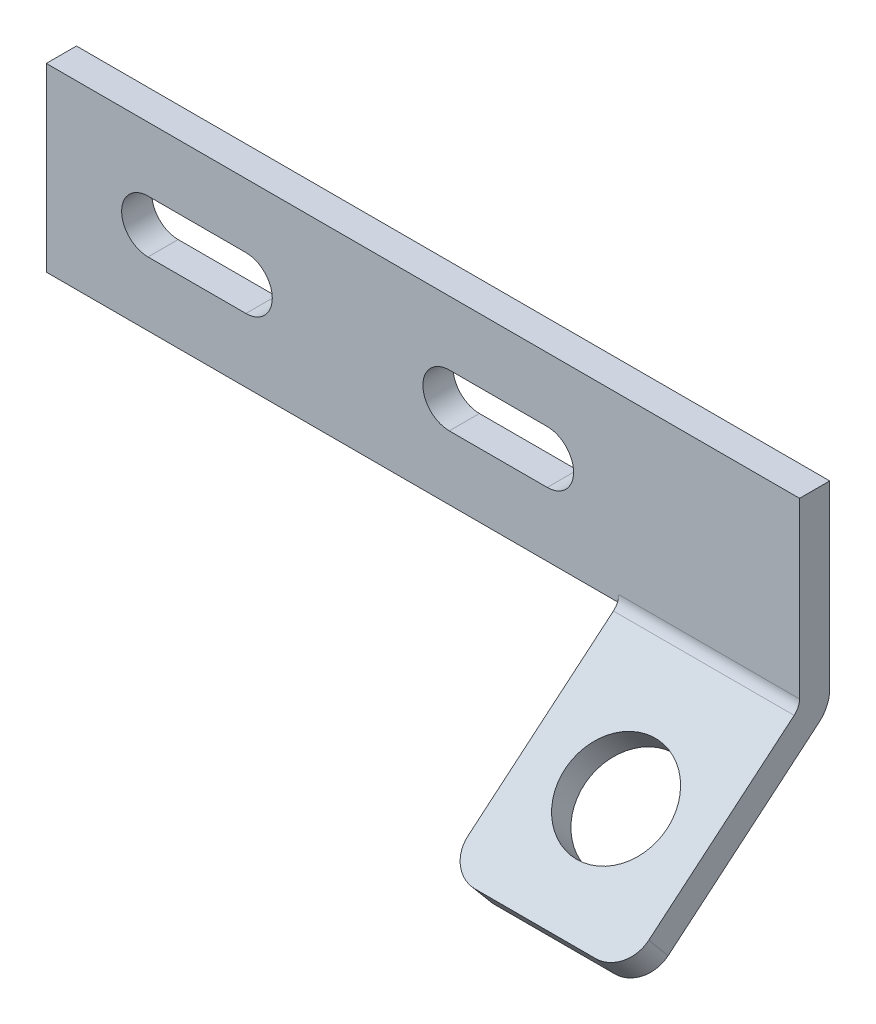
ISO-10303-21;
HEADER;
FILE_DESCRIPTION(('STEP AP214'),'2;1');
FILE_NAME('part.step','',(''),(''),'','','');
FILE_SCHEMA(('AUTOMOTIVE_DESIGN { 1 0 10303 214 1 1 1 1 }'));
ENDSEC;
DATA;
#1=APPLICATION_CONTEXT('core data for automotive mechanical design processes');
#2=APPLICATION_PROTOCOL_DEFINITION('international standard','automotive_design',2000,#1);
#3=PRODUCT_CONTEXT('',#1,'mechanical');
#4=PRODUCT('Part','Part','',(#3));
#5=PRODUCT_RELATED_PRODUCT_CATEGORY('part','',(#4));
#6=PRODUCT_DEFINITION_FORMATION('','',#4);
#7=PRODUCT_DEFINITION_CONTEXT('part definition',#1,'design');
#8=PRODUCT_DEFINITION('design','',#6,#7);
#9=PRODUCT_DEFINITION_SHAPE('','',#8);
#10=(LENGTH_UNIT() NAMED_UNIT(*) SI_UNIT(.MILLI.,.METRE.));
#11=(NAMED_UNIT(*) PLANE_ANGLE_UNIT() SI_UNIT($,.RADIAN.));
#12=(NAMED_UNIT(*) SI_UNIT($,.STERADIAN.) SOLID_ANGLE_UNIT());
#13=UNCERTAINTY_MEASURE_WITH_UNIT(LENGTH_MEASURE(1.E-05),#10,'distance_accuracy_value','');
#14=(GEOMETRIC_REPRESENTATION_CONTEXT(3) GLOBAL_UNCERTAINTY_ASSIGNED_CONTEXT((#13)) GLOBAL_UNIT_ASSIGNED_CONTEXT((#10,
#11,#12)) REPRESENTATION_CONTEXT('',''));
#15=CARTESIAN_POINT('',(0.,0.,0.));
#16=DIRECTION('',(0.,0.,1.));
#17=DIRECTION('',(1.,0.,0.));
#18=AXIS2_PLACEMENT_3D('',#15,#16,#17);
#19=CARTESIAN_POINT('',(-3.63955992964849,-10.6,-2.));
#20=DIRECTION('',(-1.,0.,0.));
#21=DIRECTION('',(0.,0.,1.));
#22=AXIS2_PLACEMENT_3D('',#19,#20,#21);
#23=PLANE('',#22);
#24=DIRECTION('',(0.,-1.,0.));
#25=VECTOR('',#24,1.);
#26=CARTESIAN_POINT('',(-3.63955992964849,-10.6,0.));
#27=LINE('',#26,#25);
#28=CARTESIAN_POINT('',(-3.63955992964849,1.4,0.));
#29=VERTEX_POINT('',#28);
#30=CARTESIAN_POINT('',(-3.63955992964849,-10.6,0.));
#31=VERTEX_POINT('',#30);
#32=EDGE_CURVE('E236',#29,#31,#27,.T.);
#33=ORIENTED_EDGE('',*,*,#32,.F.);
#34=DIRECTION('',(0.,0.,1.));
#35=VECTOR('',#34,1.);
#36=CARTESIAN_POINT('',(-3.63955992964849,1.4,-2.));
#37=LINE('',#36,#35);
#38=CARTESIAN_POINT('',(-3.63955992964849,1.4,-2.));
#39=VERTEX_POINT('',#38);
#40=EDGE_CURVE('E259',#39,#29,#37,.T.);
#41=ORIENTED_EDGE('',*,*,#40,.F.);
#42=DIRECTION('',(0.,-1.,0.));
#43=VECTOR('',#42,1.);
#44=CARTESIAN_POINT('',(-3.63955992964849,-10.6,-2.));
#45=LINE('',#44,#43);
#46=CARTESIAN_POINT('',(-3.63955992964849,-10.6,-2.));
#47=VERTEX_POINT('',#46);
#48=EDGE_CURVE('E237',#39,#47,#45,.T.);
#49=ORIENTED_EDGE('',*,*,#48,.T.);
#50=DIRECTION('',(0.,0.,1.));
#51=VECTOR('',#50,1.);
#52=CARTESIAN_POINT('',(-3.63955992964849,-10.6,-2.));
#53=LINE('',#52,#51);
#54=EDGE_CURVE('E249',#47,#31,#53,.T.);
#55=ORIENTED_EDGE('',*,*,#54,.T.);
#56=EDGE_LOOP('',(#33,#41,#49,#55));
#57=FACE_BOUND('',#56,.T.);
#58=ADVANCED_FACE('F16',(#57),#23,.T.);
#59=CARTESIAN_POINT('',(-3.63955992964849,1.4,-2.));
#60=DIRECTION('',(0.,1.,0.));
#61=DIRECTION('',(-1.,0.,0.));
#62=AXIS2_PLACEMENT_3D('',#59,#60,#61);
#63=PLANE('',#62);
#64=DIRECTION('',(-1.,0.,0.));
#65=VECTOR('',#64,1.);
#66=CARTESIAN_POINT('',(-3.63955992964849,1.4,0.));
#67=LINE('',#66,#65);
#68=CARTESIAN_POINT('',(46.3604400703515,1.4,0.));
#69=VERTEX_POINT('',#68);
#70=EDGE_CURVE('E241',#69,#29,#67,.T.);
#71=ORIENTED_EDGE('',*,*,#70,.F.);
#72=DIRECTION('',(0.,0.,1.));
#73=VECTOR('',#72,1.);
#74=CARTESIAN_POINT('',(46.3604400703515,1.4,-2.));
#75=LINE('',#74,#73);
#76=CARTESIAN_POINT('',(46.3604400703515,1.4,-2.));
#77=VERTEX_POINT('',#76);
#78=EDGE_CURVE('E262',#77,#69,#75,.T.);
#79=ORIENTED_EDGE('',*,*,#78,.F.);
#80=DIRECTION('',(-1.,0.,0.));
#81=VECTOR('',#80,1.);
#82=CARTESIAN_POINT('',(-3.63955992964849,1.4,-2.));
#83=LINE('',#82,#81);
#84=EDGE_CURVE('E246',#77,#39,#83,.T.);
#85=ORIENTED_EDGE('',*,*,#84,.T.);
#86=ORIENTED_EDGE('',*,*,#40,.T.);
#87=EDGE_LOOP('',(#71,#79,#85,#86));
#88=FACE_BOUND('',#87,.T.);
#89=ADVANCED_FACE('F345',(#88),#63,.T.);
#90=CARTESIAN_POINT('',(46.3604400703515,-10.6,-2.));
#91=DIRECTION('',(1.,0.,0.));
#92=DIRECTION('',(0.,0.,-1.));
#93=AXIS2_PLACEMENT_3D('',#90,#91,#92);
#94=PLANE('',#93);
#95=DIRECTION('',(0.,-0.642787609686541,0.766044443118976));
#96=VECTOR('',#95,1.);
#97=CARTESIAN_POINT('',(46.3604400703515,-20.2851281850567,11.5422863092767));
#98=LINE('',#97,#96);
#99=CARTESIAN_POINT('',(46.3604400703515,-10.899736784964,0.357212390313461));
#100=VERTEX_POINT('',#99);
#101=CARTESIAN_POINT('',(46.3604400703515,-18.9995529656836,10.0101974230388));
#102=VERTEX_POINT('',#101);
#103=EDGE_CURVE('E224',#100,#102,#98,.T.);
#104=ORIENTED_EDGE('',*,*,#103,.T.);
#105=DIRECTION('',(0.,-0.766044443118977,-0.642787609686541));
#106=VECTOR('',#105,1.);
#107=CARTESIAN_POINT('',(46.3604400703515,-19.9843607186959,9.18384560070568));
#108=LINE('',#107,#106);
#109=CARTESIAN_POINT('',(46.3604400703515,-20.5316418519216,8.72462220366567));
#110=VERTEX_POINT('',#109);
#111=EDGE_CURVE('E287',#102,#110,#108,.T.);
#112=ORIENTED_EDGE('',*,*,#111,.T.);
#113=DIRECTION('',(0.,0.642787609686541,-0.766044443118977));
#114=VECTOR('',#113,1.);
#115=CARTESIAN_POINT('',(46.3604400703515,-11.53261531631,-2.));
#116=LINE('',#115,#114);
#117=CARTESIAN_POINT('',(46.3604400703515,-12.132088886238,-1.28557521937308));
#118=VERTEX_POINT('',#117);
#119=EDGE_CURVE('E221',#110,#118,#116,.T.);
#120=ORIENTED_EDGE('',*,*,#119,.T.);
#121=CARTESIAN_POINT('',(46.3604400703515,-10.6,0.));
#122=DIRECTION('',(1.,0.,0.));
#123=DIRECTION('',(0.,0.,-1.));
#124=AXIS2_PLACEMENT_3D('',#121,#122,#123);
#125=CIRCLE('',#124,2.);
#126=CARTESIAN_POINT('',(46.3604400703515,-10.6,-2.));
#127=VERTEX_POINT('',#126);
#128=EDGE_CURVE('E268',#118,#127,#125,.T.);
#129=ORIENTED_EDGE('',*,*,#128,.T.);
#130=DIRECTION('',(0.,1.,0.));
#131=VECTOR('',#130,1.);
#132=CARTESIAN_POINT('',(46.3604400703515,-10.6,-2.));
#133=LINE('',#132,#131);
#134=EDGE_CURVE('E244',#127,#77,#133,.T.);
#135=ORIENTED_EDGE('',*,*,#134,.T.);
#136=ORIENTED_EDGE('',*,*,#78,.T.);
#137=DIRECTION('',(0.,1.,0.));
#138=VECTOR('',#137,1.);
#139=CARTESIAN_POINT('',(46.3604400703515,-10.6,0.));
#140=LINE('',#139,#138);
#141=CARTESIAN_POINT('',(46.3604400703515,-10.133692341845,0.));
#142=VERTEX_POINT('',#141);
#143=EDGE_CURVE('E255',#142,#69,#140,.T.);
#144=ORIENTED_EDGE('',*,*,#143,.F.);
#145=CARTESIAN_POINT('',(46.3604400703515,-10.133692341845,1.));
#146=DIRECTION('',(1.,0.,0.));
#147=DIRECTION('',(0.,0.,-1.));
#148=AXIS2_PLACEMENT_3D('',#145,#146,#147);
#149=CIRCLE('',#148,1.);
#150=EDGE_CURVE('E283',#142,#100,#149,.F.);
#151=ORIENTED_EDGE('',*,*,#150,.T.);
#152=EDGE_LOOP('',(#104,#112,#120,#129,#135,#136,#144,#151));
#153=FACE_BOUND('',#152,.T.);
#154=ADVANCED_FACE('F312',(#153),#94,.T.);
#155=CARTESIAN_POINT('',(-3.63955992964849,-10.6,-2.));
#156=DIRECTION('',(0.,-1.,0.));
#157=DIRECTION('',(0.,0.,-1.));
#158=AXIS2_PLACEMENT_3D('',#155,#156,#157);
#159=PLANE('',#158);
#160=DIRECTION('',(0.,0.,-1.));
#161=VECTOR('',#160,1.);
#162=CARTESIAN_POINT('',(34.3604400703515,-10.6,-2.));
#163=LINE('',#162,#161);
#164=CARTESIAN_POINT('',(34.3604400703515,-10.6,0.));
#165=VERTEX_POINT('',#164);
#166=CARTESIAN_POINT('',(34.3604400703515,-10.6,-2.));
#167=VERTEX_POINT('',#166);
#168=EDGE_CURVE('E231',#165,#167,#163,.T.);
#169=ORIENTED_EDGE('',*,*,#168,.F.);
#170=DIRECTION('',(1.,0.,0.));
#171=VECTOR('',#170,1.);
#172=CARTESIAN_POINT('',(-3.63955992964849,-10.6,0.));
#173=LINE('',#172,#171);
#174=EDGE_CURVE('E252',#31,#165,#173,.T.);
#175=ORIENTED_EDGE('',*,*,#174,.F.);
#176=ORIENTED_EDGE('',*,*,#54,.F.);
#177=DIRECTION('',(1.,0.,0.));
#178=VECTOR('',#177,1.);
#179=CARTESIAN_POINT('',(-3.63955992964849,-10.6,-2.));
#180=LINE('',#179,#178);
#181=EDGE_CURVE('E240',#47,#167,#180,.T.);
#182=ORIENTED_EDGE('',*,*,#181,.T.);
#183=EDGE_LOOP('',(#169,#175,#176,#182));
#184=FACE_BOUND('',#183,.T.);
#185=ADVANCED_FACE('F354',(#184),#159,.T.);
#186=CARTESIAN_POINT('',(0.,0.,-2.));
#187=DIRECTION('',(0.,0.,-1.));
#188=DIRECTION('',(-1.,0.,0.));
#189=AXIS2_PLACEMENT_3D('',#186,#187,#188);
#190=PLANE('',#189);
#191=CARTESIAN_POINT('',(3.11044007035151,-4.6,-2.));
#192=DIRECTION('',(0.,0.,1.));
#193=DIRECTION('',(1.,0.,0.));
#194=AXIS2_PLACEMENT_3D('',#191,#192,#193);
#195=CIRCLE('',#194,1.75);
#196=CARTESIAN_POINT('',(3.11044007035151,-2.85,-2.));
#197=VERTEX_POINT('',#196);
#198=CARTESIAN_POINT('',(3.11044007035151,-6.35,-2.));
#199=VERTEX_POINT('',#198);
#200=EDGE_CURVE('E163',#197,#199,#195,.T.);
#201=ORIENTED_EDGE('',*,*,#200,.T.);
#202=DIRECTION('',(1.,0.,0.));
#203=VECTOR('',#202,1.);
#204=CARTESIAN_POINT('',(3.11044007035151,-6.35,-2.));
#205=LINE('',#204,#203);
#206=CARTESIAN_POINT('',(9.61044007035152,-6.35,-2.));
#207=VERTEX_POINT('',#206);
#208=EDGE_CURVE('E547',#199,#207,#205,.T.);
#209=ORIENTED_EDGE('',*,*,#208,.T.);
#210=CARTESIAN_POINT('',(9.61044007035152,-4.6,-2.));
#211=DIRECTION('',(0.,0.,1.));
#212=DIRECTION('',(1.,0.,0.));
#213=AXIS2_PLACEMENT_3D('',#210,#211,#212);
#214=CIRCLE('',#213,1.75);
#215=CARTESIAN_POINT('',(9.61044007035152,-2.85,-2.));
#216=VERTEX_POINT('',#215);
#217=EDGE_CURVE('E178',#207,#216,#214,.T.);
#218=ORIENTED_EDGE('',*,*,#217,.T.);
#219=DIRECTION('',(1.,0.,0.));
#220=VECTOR('',#219,1.);
#221=CARTESIAN_POINT('',(3.11044007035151,-2.85,-2.));
#222=LINE('',#221,#220);
#223=EDGE_CURVE('E159',#197,#216,#222,.T.);
#224=ORIENTED_EDGE('',*,*,#223,.F.);
#225=EDGE_LOOP('',(#201,#209,#218,#224));
#226=FACE_BOUND('',#225,.T.);
#227=DIRECTION('',(1.,0.,0.));
#228=VECTOR('',#227,1.);
#229=CARTESIAN_POINT('',(23.1104400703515,-2.85,-2.));
#230=LINE('',#229,#228);
#231=CARTESIAN_POINT('',(23.1104400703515,-2.85,-2.));
#232=VERTEX_POINT('',#231);
#233=CARTESIAN_POINT('',(29.6104400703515,-2.85,-2.));
#234=VERTEX_POINT('',#233);
#235=EDGE_CURVE('E188',#232,#234,#230,.T.);
#236=ORIENTED_EDGE('',*,*,#235,.F.);
#237=CARTESIAN_POINT('',(23.1104400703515,-4.6,-2.));
#238=DIRECTION('',(0.,0.,1.));
#239=DIRECTION('',(1.,0.,0.));
#240=AXIS2_PLACEMENT_3D('',#237,#238,#239);
#241=CIRCLE('',#240,1.75);
#242=CARTESIAN_POINT('',(23.1104400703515,-6.35,-2.));
#243=VERTEX_POINT('',#242);
#244=EDGE_CURVE('E195',#232,#243,#241,.T.);
#245=ORIENTED_EDGE('',*,*,#244,.T.);
#246=DIRECTION('',(1.,0.,0.));
#247=VECTOR('',#246,1.);
#248=CARTESIAN_POINT('',(23.1104400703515,-6.35,-2.));
#249=LINE('',#248,#247);
#250=CARTESIAN_POINT('',(29.6104400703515,-6.35,-2.));
#251=VERTEX_POINT('',#250);
#252=EDGE_CURVE('E185',#243,#251,#249,.T.);
#253=ORIENTED_EDGE('',*,*,#252,.T.);
#254=CARTESIAN_POINT('',(29.6104400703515,-4.6,-2.));
#255=DIRECTION('',(0.,0.,1.));
#256=DIRECTION('',(1.,0.,0.));
#257=AXIS2_PLACEMENT_3D('',#254,#255,#256);
#258=CIRCLE('',#257,1.75);
#259=EDGE_CURVE('E206',#251,#234,#258,.T.);
#260=ORIENTED_EDGE('',*,*,#259,.T.);
#261=EDGE_LOOP('',(#236,#245,#253,#260));
#262=FACE_BOUND('',#261,.T.);
#263=ORIENTED_EDGE('',*,*,#134,.F.);
#264=DIRECTION('',(1.,0.,0.));
#265=VECTOR('',#264,1.);
#266=CARTESIAN_POINT('',(0.,-10.6,-2.));
#267=LINE('',#266,#265);
#268=EDGE_CURVE('E270',#127,#167,#267,.F.);
#269=ORIENTED_EDGE('',*,*,#268,.T.);
#270=ORIENTED_EDGE('',*,*,#181,.F.);
#271=ORIENTED_EDGE('',*,*,#48,.F.);
#272=ORIENTED_EDGE('',*,*,#84,.F.);
#273=EDGE_LOOP('',(#263,#269,#270,#271,#272));
#274=FACE_BOUND('',#273,.T.);
#275=ADVANCED_FACE('F340',(#226,#262,#274),#190,.T.);
#276=CARTESIAN_POINT('',(0.,0.,0.));
#277=DIRECTION('',(0.,0.,-1.));
#278=DIRECTION('',(-1.,0.,0.));
#279=AXIS2_PLACEMENT_3D('',#276,#277,#278);
#280=PLANE('',#279);
#281=CARTESIAN_POINT('',(3.11044007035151,-4.6,0.));
#282=DIRECTION('',(0.,0.,1.));
#283=DIRECTION('',(1.,0.,0.));
#284=AXIS2_PLACEMENT_3D('',#281,#282,#283);
#285=CIRCLE('',#284,1.75);
#286=CARTESIAN_POINT('',(3.11044007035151,-2.85,0.));
#287=VERTEX_POINT('',#286);
#288=CARTESIAN_POINT('',(3.11044007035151,-6.35,0.));
#289=VERTEX_POINT('',#288);
#290=EDGE_CURVE('E39',#287,#289,#285,.T.);
#291=ORIENTED_EDGE('',*,*,#290,.F.);
#292=DIRECTION('',(1.,0.,0.));
#293=VECTOR('',#292,1.);
#294=CARTESIAN_POINT('',(3.11044007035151,-2.85,0.));
#295=LINE('',#294,#293);
#296=CARTESIAN_POINT('',(9.61044007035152,-2.85,0.));
#297=VERTEX_POINT('',#296);
#298=EDGE_CURVE('E150',#287,#297,#295,.T.);
#299=ORIENTED_EDGE('',*,*,#298,.T.);
#300=CARTESIAN_POINT('',(9.61044007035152,-4.6,0.));
#301=DIRECTION('',(0.,0.,1.));
#302=DIRECTION('',(1.,0.,0.));
#303=AXIS2_PLACEMENT_3D('',#300,#301,#302);
#304=CIRCLE('',#303,1.75);
#305=CARTESIAN_POINT('',(9.61044007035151,-6.35,0.));
#306=VERTEX_POINT('',#305);
#307=EDGE_CURVE('E165',#306,#297,#304,.T.);
#308=ORIENTED_EDGE('',*,*,#307,.F.);
#309=DIRECTION('',(1.,0.,0.));
#310=VECTOR('',#309,1.);
#311=CARTESIAN_POINT('',(3.11044007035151,-6.35,0.));
#312=LINE('',#311,#310);
#313=EDGE_CURVE('E171',#289,#306,#312,.T.);
#314=ORIENTED_EDGE('',*,*,#313,.F.);
#315=EDGE_LOOP('',(#291,#299,#308,#314));
#316=FACE_BOUND('',#315,.T.);
#317=DIRECTION('',(1.,0.,0.));
#318=VECTOR('',#317,1.);
#319=CARTESIAN_POINT('',(23.1104400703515,-2.85,0.));
#320=LINE('',#319,#318);
#321=CARTESIAN_POINT('',(23.1104400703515,-2.85,0.));
#322=VERTEX_POINT('',#321);
#323=CARTESIAN_POINT('',(29.6104400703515,-2.85,0.));
#324=VERTEX_POINT('',#323);
#325=EDGE_CURVE('E190',#322,#324,#320,.T.);
#326=ORIENTED_EDGE('',*,*,#325,.T.);
#327=CARTESIAN_POINT('',(29.6104400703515,-4.6,0.));
#328=DIRECTION('',(0.,0.,1.));
#329=DIRECTION('',(1.,0.,0.));
#330=AXIS2_PLACEMENT_3D('',#327,#328,#329);
#331=CIRCLE('',#330,1.75);
#332=CARTESIAN_POINT('',(29.6104400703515,-6.35,0.));
#333=VERTEX_POINT('',#332);
#334=EDGE_CURVE('E203',#333,#324,#331,.T.);
#335=ORIENTED_EDGE('',*,*,#334,.F.);
#336=DIRECTION('',(1.,0.,0.));
#337=VECTOR('',#336,1.);
#338=CARTESIAN_POINT('',(23.1104400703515,-6.35,0.));
#339=LINE('',#338,#337);
#340=CARTESIAN_POINT('',(23.1104400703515,-6.35,0.));
#341=VERTEX_POINT('',#340);
#342=EDGE_CURVE('E183',#341,#333,#339,.T.);
#343=ORIENTED_EDGE('',*,*,#342,.F.);
#344=CARTESIAN_POINT('',(23.1104400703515,-4.6,0.));
#345=DIRECTION('',(0.,0.,1.));
#346=DIRECTION('',(1.,0.,0.));
#347=AXIS2_PLACEMENT_3D('',#344,#345,#346);
#348=CIRCLE('',#347,1.75);
#349=EDGE_CURVE('E193',#322,#341,#348,.T.);
#350=ORIENTED_EDGE('',*,*,#349,.F.);
#351=EDGE_LOOP('',(#326,#335,#343,#350));
#352=FACE_BOUND('',#351,.T.);
#353=DIRECTION('',(0.,1.,0.));
#354=VECTOR('',#353,1.);
#355=CARTESIAN_POINT('',(34.3604400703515,0.,0.));
#356=LINE('',#355,#354);
#357=CARTESIAN_POINT('',(34.3604400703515,-10.133692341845,0.));
#358=VERTEX_POINT('',#357);
#359=EDGE_CURVE('E275',#165,#358,#356,.T.);
#360=ORIENTED_EDGE('',*,*,#359,.T.);
#361=DIRECTION('',(1.,0.,0.));
#362=VECTOR('',#361,1.);
#363=CARTESIAN_POINT('',(0.,-10.133692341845,0.));
#364=LINE('',#363,#362);
#365=EDGE_CURVE('E278',#358,#142,#364,.T.);
#366=ORIENTED_EDGE('',*,*,#365,.T.);
#367=ORIENTED_EDGE('',*,*,#143,.T.);
#368=ORIENTED_EDGE('',*,*,#70,.T.);
#369=ORIENTED_EDGE('',*,*,#32,.T.);
#370=ORIENTED_EDGE('',*,*,#174,.T.);
#371=EDGE_LOOP('',(#360,#366,#367,#368,#369,#370));
#372=FACE_BOUND('',#371,.T.);
#373=ADVANCED_FACE('F169',(#316,#352,#372),#280,.F.);
#374=CARTESIAN_POINT('',(34.3604400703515,-20.2851281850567,11.5422863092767));
#375=DIRECTION('',(0.,0.766044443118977,0.642787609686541));
#376=DIRECTION('',(0.,-0.642787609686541,0.766044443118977));
#377=AXIS2_PLACEMENT_3D('',#374,#375,#376);
#378=PLANE('',#377);
#379=CARTESIAN_POINT('',(40.3604400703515,-15.7856149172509,6.17997520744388));
#380=DIRECTION('',(0.,0.766044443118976,0.642787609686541));
#381=DIRECTION('',(0.,-0.642787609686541,0.766044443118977));
#382=AXIS2_PLACEMENT_3D('',#379,#380,#381);
#383=CIRCLE('',#382,3.4);
#384=CARTESIAN_POINT('',(40.3604400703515,-17.9710927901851,8.7845263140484));
#385=VERTEX_POINT('',#384);
#386=EDGE_CURVE('E213',#385,#385,#383,.T.);
#387=ORIENTED_EDGE('',*,*,#386,.F.);
#388=EDGE_LOOP('',(#387));
#389=FACE_BOUND('',#388,.T.);
#390=DIRECTION('',(1.,0.,0.));
#391=VECTOR('',#390,1.);
#392=CARTESIAN_POINT('',(34.3604400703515,-20.2851281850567,11.5422863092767));
#393=LINE('',#392,#391);
#394=CARTESIAN_POINT('',(36.3604400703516,-20.2851281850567,11.5422863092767));
#395=VERTEX_POINT('',#394);
#396=CARTESIAN_POINT('',(44.3604400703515,-20.2851281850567,11.5422863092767));
#397=VERTEX_POINT('',#396);
#398=EDGE_CURVE('E223',#395,#397,#393,.T.);
#399=ORIENTED_EDGE('',*,*,#398,.T.);
#400=CARTESIAN_POINT('',(44.3604400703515,-18.9995529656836,10.0101974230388));
#401=DIRECTION('',(0.,0.766044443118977,0.642787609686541));
#402=DIRECTION('',(0.,-0.642787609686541,0.766044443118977));
#403=AXIS2_PLACEMENT_3D('',#400,#401,#402);
#404=CIRCLE('',#403,2.);
#405=EDGE_CURVE('E24',#397,#102,#404,.T.);
#406=ORIENTED_EDGE('',*,*,#405,.T.);
#407=ORIENTED_EDGE('',*,*,#103,.F.);
#408=DIRECTION('',(1.,0.,0.));
#409=VECTOR('',#408,1.);
#410=CARTESIAN_POINT('',(34.3604400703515,-10.899736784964,0.357212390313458));
#411=LINE('',#410,#409);
#412=CARTESIAN_POINT('',(34.3604400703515,-10.899736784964,0.357212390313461));
#413=VERTEX_POINT('',#412);
#414=EDGE_CURVE('E281',#100,#413,#411,.F.);
#415=ORIENTED_EDGE('',*,*,#414,.T.);
#416=DIRECTION('',(0.,-0.642787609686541,0.766044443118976));
#417=VECTOR('',#416,1.);
#418=CARTESIAN_POINT('',(34.3604400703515,-20.2851281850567,11.5422863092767));
#419=LINE('',#418,#417);
#420=CARTESIAN_POINT('',(34.3604400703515,-18.9995529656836,10.0101974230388));
#421=VERTEX_POINT('',#420);
#422=EDGE_CURVE('E217',#413,#421,#419,.T.);
#423=ORIENTED_EDGE('',*,*,#422,.T.);
#424=CARTESIAN_POINT('',(36.3604400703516,-18.9995529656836,10.0101974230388));
#425=DIRECTION('',(0.,0.766044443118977,0.642787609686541));
#426=DIRECTION('',(0.,-0.642787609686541,0.766044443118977));
#427=AXIS2_PLACEMENT_3D('',#424,#425,#426);
#428=CIRCLE('',#427,2.);
#429=EDGE_CURVE('E301',#421,#395,#428,.T.);
#430=ORIENTED_EDGE('',*,*,#429,.T.);
#431=EDGE_LOOP('',(#399,#406,#407,#415,#423,#430));
#432=FACE_BOUND('',#431,.T.);
#433=ADVANCED_FACE('F305',(#389,#432),#378,.T.);
#434=CARTESIAN_POINT('',(34.3604400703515,-11.53261531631,-2.));
#435=DIRECTION('',(0.,-0.766044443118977,-0.642787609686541));
#436=DIRECTION('',(0.,0.642787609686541,-0.766044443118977));
#437=AXIS2_PLACEMENT_3D('',#434,#435,#436);
#438=PLANE('',#437);
#439=CARTESIAN_POINT('',(40.3604400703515,-17.3177038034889,4.8943999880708));
#440=DIRECTION('',(0.,-0.766044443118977,-0.642787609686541));
#441=DIRECTION('',(0.,0.642787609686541,-0.766044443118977));
#442=AXIS2_PLACEMENT_3D('',#439,#440,#441);
#443=CIRCLE('',#442,3.4);
#444=CARTESIAN_POINT('',(40.3604400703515,-19.5031816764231,7.49895109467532));
#445=VERTEX_POINT('',#444);
#446=EDGE_CURVE('E216',#445,#445,#443,.T.);
#447=ORIENTED_EDGE('',*,*,#446,.F.);
#448=EDGE_LOOP('',(#447));
#449=FACE_BOUND('',#448,.T.);
#450=ORIENTED_EDGE('',*,*,#119,.F.);
#451=CARTESIAN_POINT('',(44.3604400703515,-20.5316418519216,8.72462220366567));
#452=DIRECTION('',(0.,-0.766044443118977,-0.642787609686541));
#453=DIRECTION('',(0.,0.642787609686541,-0.766044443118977));
#454=AXIS2_PLACEMENT_3D('',#451,#452,#453);
#455=CIRCLE('',#454,2.);
#456=CARTESIAN_POINT('',(44.3604400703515,-21.8172170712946,10.2567110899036));
#457=VERTEX_POINT('',#456);
#458=EDGE_CURVE('E294',#110,#457,#455,.T.);
#459=ORIENTED_EDGE('',*,*,#458,.T.);
#460=DIRECTION('',(1.,0.,0.));
#461=VECTOR('',#460,1.);
#462=CARTESIAN_POINT('',(34.3604400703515,-21.8172170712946,10.2567110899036));
#463=LINE('',#462,#461);
#464=CARTESIAN_POINT('',(36.3604400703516,-21.8172170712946,10.2567110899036));
#465=VERTEX_POINT('',#464);
#466=EDGE_CURVE('E228',#465,#457,#463,.T.);
#467=ORIENTED_EDGE('',*,*,#466,.F.);
#468=CARTESIAN_POINT('',(36.3604400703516,-20.5316418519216,8.72462220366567));
#469=DIRECTION('',(0.,-0.766044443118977,-0.642787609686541));
#470=DIRECTION('',(0.,0.642787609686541,-0.766044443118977));
#471=AXIS2_PLACEMENT_3D('',#468,#469,#470);
#472=CIRCLE('',#471,2.);
#473=CARTESIAN_POINT('',(34.3604400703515,-20.5316418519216,8.72462220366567));
#474=VERTEX_POINT('',#473);
#475=EDGE_CURVE('E292',#465,#474,#472,.T.);
#476=ORIENTED_EDGE('',*,*,#475,.T.);
#477=DIRECTION('',(0.,0.642787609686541,-0.766044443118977));
#478=VECTOR('',#477,1.);
#479=CARTESIAN_POINT('',(34.3604400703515,-11.53261531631,-2.));
#480=LINE('',#479,#478);
#481=CARTESIAN_POINT('',(34.3604400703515,-12.132088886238,-1.28557521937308));
#482=VERTEX_POINT('',#481);
#483=EDGE_CURVE('E220',#474,#482,#480,.T.);
#484=ORIENTED_EDGE('',*,*,#483,.T.);
#485=DIRECTION('',(1.,0.,0.));
#486=VECTOR('',#485,1.);
#487=CARTESIAN_POINT('',(34.3604400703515,-12.132088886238,-1.28557521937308));
#488=LINE('',#487,#486);
#489=EDGE_CURVE('E261',#482,#118,#488,.T.);
#490=ORIENTED_EDGE('',*,*,#489,.T.);
#491=EDGE_LOOP('',(#450,#459,#467,#476,#484,#490));
#492=FACE_BOUND('',#491,.T.);
#493=ADVANCED_FACE('F318',(#449,#492),#438,.T.);
#494=CARTESIAN_POINT('',(34.3604400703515,-21.8172170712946,10.2567110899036));
#495=DIRECTION('',(0.,-0.642787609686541,0.766044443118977));
#496=DIRECTION('',(0.,-0.766044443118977,-0.642787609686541));
#497=AXIS2_PLACEMENT_3D('',#494,#495,#496);
#498=PLANE('',#497);
#499=ORIENTED_EDGE('',*,*,#466,.T.);
#500=DIRECTION('',(0.,-0.766044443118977,-0.642787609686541));
#501=VECTOR('',#500,1.);
#502=CARTESIAN_POINT('',(44.3604400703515,-21.8172170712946,10.2567110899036));
#503=LINE('',#502,#501);
#504=EDGE_CURVE('E299',#457,#397,#503,.F.);
#505=ORIENTED_EDGE('',*,*,#504,.T.);
#506=ORIENTED_EDGE('',*,*,#398,.F.);
#507=DIRECTION('',(0.,-0.766044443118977,-0.642787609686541));
#508=VECTOR('',#507,1.);
#509=CARTESIAN_POINT('',(36.3604400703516,-21.8172170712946,10.2567110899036));
#510=LINE('',#509,#508);
#511=EDGE_CURVE('E296',#395,#465,#510,.T.);
#512=ORIENTED_EDGE('',*,*,#511,.T.);
#513=EDGE_LOOP('',(#499,#505,#506,#512));
#514=FACE_BOUND('',#513,.T.);
#515=ADVANCED_FACE('F320',(#514),#498,.T.);
#516=CARTESIAN_POINT('',(34.3604400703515,0.,0.));
#517=DIRECTION('',(-1.,0.,0.));
#518=DIRECTION('',(0.,0.,1.));
#519=AXIS2_PLACEMENT_3D('',#516,#517,#518);
#520=PLANE('',#519);
#521=ORIENTED_EDGE('',*,*,#483,.F.);
#522=DIRECTION('',(0.,-0.766044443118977,-0.642787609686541));
#523=VECTOR('',#522,1.);
#524=CARTESIAN_POINT('',(34.3604400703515,-12.7792176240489,15.2296785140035));
#525=LINE('',#524,#523);
#526=EDGE_CURVE('E11',#474,#421,#525,.F.);
#527=ORIENTED_EDGE('',*,*,#526,.T.);
#528=ORIENTED_EDGE('',*,*,#422,.F.);
#529=CARTESIAN_POINT('',(34.3604400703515,-10.133692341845,1.));
#530=DIRECTION('',(-1.,0.,0.));
#531=DIRECTION('',(0.,0.,1.));
#532=AXIS2_PLACEMENT_3D('',#529,#530,#531);
#533=CIRCLE('',#532,1.);
#534=EDGE_CURVE('E285',#413,#358,#533,.F.);
#535=ORIENTED_EDGE('',*,*,#534,.T.);
#536=ORIENTED_EDGE('',*,*,#359,.F.);
#537=ORIENTED_EDGE('',*,*,#168,.T.);
#538=CARTESIAN_POINT('',(34.3604400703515,-10.6,0.));
#539=DIRECTION('',(-1.,0.,0.));
#540=DIRECTION('',(0.,0.,1.));
#541=AXIS2_PLACEMENT_3D('',#538,#539,#540);
#542=CIRCLE('',#541,2.);
#543=EDGE_CURVE('E272',#167,#482,#542,.T.);
#544=ORIENTED_EDGE('',*,*,#543,.T.);
#545=EDGE_LOOP('',(#521,#527,#528,#535,#536,#537,#544));
#546=FACE_BOUND('',#545,.T.);
#547=ADVANCED_FACE('F327',(#546),#520,.T.);
#548=CARTESIAN_POINT('',(34.3604400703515,-10.6,0.));
#549=DIRECTION('',(1.,0.,0.));
#550=DIRECTION('',(0.,0.,-1.));
#551=AXIS2_PLACEMENT_3D('',#548,#549,#550);
#552=CYLINDRICAL_SURFACE('',#551,2.);
#553=ORIENTED_EDGE('',*,*,#543,.F.);
#554=ORIENTED_EDGE('',*,*,#268,.F.);
#555=ORIENTED_EDGE('',*,*,#128,.F.);
#556=ORIENTED_EDGE('',*,*,#489,.F.);
#557=EDGE_LOOP('',(#553,#554,#555,#556));
#558=FACE_BOUND('',#557,.T.);
#559=ADVANCED_FACE('F335',(#558),#552,.T.);
#560=CARTESIAN_POINT('',(0.,-10.133692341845,1.));
#561=DIRECTION('',(1.,0.,0.));
#562=DIRECTION('',(0.,0.,-1.));
#563=AXIS2_PLACEMENT_3D('',#560,#561,#562);
#564=CYLINDRICAL_SURFACE('',#563,1.);
#565=ORIENTED_EDGE('',*,*,#534,.F.);
#566=ORIENTED_EDGE('',*,*,#414,.F.);
#567=ORIENTED_EDGE('',*,*,#150,.F.);
#568=ORIENTED_EDGE('',*,*,#365,.F.);
#569=EDGE_LOOP('',(#565,#566,#567,#568));
#570=FACE_BOUND('',#569,.T.);
#571=ADVANCED_FACE('F351',(#570),#564,.F.);
#572=CARTESIAN_POINT('',(40.3604400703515,-15.7856149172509,6.17997520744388));
#573=DIRECTION('',(0.,0.766044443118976,0.642787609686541));
#574=DIRECTION('',(0.,-0.642787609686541,0.766044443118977));
#575=AXIS2_PLACEMENT_3D('',#572,#573,#574);
#576=CYLINDRICAL_SURFACE('',#575,3.4);
#577=CARTESIAN_POINT('',(40.3604400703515,-19.5031816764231,7.49895109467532));
#578=CARTESIAN_POINT('',(40.3604400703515,-19.4872224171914,7.51234250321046));
#579=CARTESIAN_POINT('',(40.3604400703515,-19.4712631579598,7.52573391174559));
#580=CARTESIAN_POINT('',(40.3604400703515,-19.4393446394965,7.55251672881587));
#581=CARTESIAN_POINT('',(40.3604400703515,-19.4233853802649,7.565908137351));
#582=CARTESIAN_POINT('',(40.3604400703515,-19.3914668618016,7.59269095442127));
#583=CARTESIAN_POINT('',(40.3604400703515,-19.3755076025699,7.60608236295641));
#584=CARTESIAN_POINT('',(40.3604400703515,-19.3435890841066,7.63286518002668));
#585=CARTESIAN_POINT('',(40.3604400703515,-19.327629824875,7.64625658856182));
#586=CARTESIAN_POINT('',(40.3604400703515,-19.2957113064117,7.67303940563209));
#587=CARTESIAN_POINT('',(40.3604400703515,-19.2797520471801,7.68643081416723));
#588=CARTESIAN_POINT('',(40.3604400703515,-19.2478335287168,7.7132136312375));
#589=CARTESIAN_POINT('',(40.3604400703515,-19.2318742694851,7.72660503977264));
#590=CARTESIAN_POINT('',(40.3604400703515,-19.1999557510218,7.75338785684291));
#591=CARTESIAN_POINT('',(40.3604400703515,-19.1839964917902,7.76677926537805));
#592=CARTESIAN_POINT('',(40.3604400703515,-19.1520779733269,7.79356208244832));
#593=CARTESIAN_POINT('',(40.3604400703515,-19.1361187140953,7.80695349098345));
#594=CARTESIAN_POINT('',(40.3604400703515,-19.104200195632,7.83373630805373));
#595=CARTESIAN_POINT('',(40.3604400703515,-19.0882409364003,7.84712771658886));
#596=CARTESIAN_POINT('',(40.3604400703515,-19.056322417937,7.87391053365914));
#597=CARTESIAN_POINT('',(40.3604400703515,-19.0403631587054,7.88730194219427));
#598=CARTESIAN_POINT('',(40.3604400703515,-19.0084446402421,7.91408475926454));
#599=CARTESIAN_POINT('',(40.3604400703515,-18.9924853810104,7.92747616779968));
#600=CARTESIAN_POINT('',(40.3604400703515,-18.9605668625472,7.95425898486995));
#601=CARTESIAN_POINT('',(40.3604400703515,-18.9446076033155,7.96765039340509));
#602=CARTESIAN_POINT('',(40.3604400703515,-18.9126890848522,7.99443321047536));
#603=CARTESIAN_POINT('',(40.3604400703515,-18.8967298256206,8.0078246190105));
#604=CARTESIAN_POINT('',(40.3604400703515,-18.8648113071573,8.03460743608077));
#605=CARTESIAN_POINT('',(40.3604400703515,-18.8488520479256,8.04799884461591));
#606=CARTESIAN_POINT('',(40.3604400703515,-18.8169335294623,8.07478166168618));
#607=CARTESIAN_POINT('',(40.3604400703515,-18.8009742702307,8.08817307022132));
#608=CARTESIAN_POINT('',(40.3604400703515,-18.7690557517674,8.11495588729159));
#609=CARTESIAN_POINT('',(40.3604400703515,-18.7530964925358,8.12834729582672));
#610=CARTESIAN_POINT('',(40.3604400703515,-18.7211779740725,8.155130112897));
#611=CARTESIAN_POINT('',(40.3604400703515,-18.7052187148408,8.16852152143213));
#612=CARTESIAN_POINT('',(40.3604400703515,-18.6733001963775,8.1953043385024));
#613=CARTESIAN_POINT('',(40.3604400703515,-18.6573409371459,8.20869574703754));
#614=CARTESIAN_POINT('',(40.3604400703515,-18.6254224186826,8.23547856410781));
#615=CARTESIAN_POINT('',(40.3604400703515,-18.609463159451,8.24886997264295));
#616=CARTESIAN_POINT('',(40.3604400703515,-18.5775446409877,8.27565278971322));
#617=CARTESIAN_POINT('',(40.3604400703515,-18.561585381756,8.28904419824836));
#618=CARTESIAN_POINT('',(40.3604400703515,-18.5296668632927,8.31582701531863));
#619=CARTESIAN_POINT('',(40.3604400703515,-18.5137076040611,8.32921842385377));
#620=CARTESIAN_POINT('',(40.3604400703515,-18.4817890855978,8.35600124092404));
#621=CARTESIAN_POINT('',(40.3604400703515,-18.4658298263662,8.36939264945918));
#622=CARTESIAN_POINT('',(40.3604400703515,-18.4339113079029,8.39617546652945));
#623=CARTESIAN_POINT('',(40.3604400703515,-18.4179520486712,8.40956687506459));
#624=CARTESIAN_POINT('',(40.3604400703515,-18.3860335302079,8.43634969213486));
#625=CARTESIAN_POINT('',(40.3604400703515,-18.3700742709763,8.44974110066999));
#626=CARTESIAN_POINT('',(40.3604400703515,-18.338155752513,8.47652391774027));
#627=CARTESIAN_POINT('',(40.3604400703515,-18.3221964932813,8.4899153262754));
#628=CARTESIAN_POINT('',(40.3604400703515,-18.290277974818,8.51669814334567));
#629=CARTESIAN_POINT('',(40.3604400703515,-18.2743187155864,8.53008955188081));
#630=CARTESIAN_POINT('',(40.3604400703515,-18.2424001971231,8.55687236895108));
#631=CARTESIAN_POINT('',(40.3604400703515,-18.2264409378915,8.57026377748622));
#632=CARTESIAN_POINT('',(40.3604400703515,-18.1945224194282,8.59704659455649));
#633=CARTESIAN_POINT('',(40.3604400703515,-18.1785631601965,8.61043800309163));
#634=CARTESIAN_POINT('',(40.3604400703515,-18.1466446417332,8.6372208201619));
#635=CARTESIAN_POINT('',(40.3604400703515,-18.1306853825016,8.65061222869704));
#636=CARTESIAN_POINT('',(40.3604400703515,-18.0987668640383,8.67739504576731));
#637=CARTESIAN_POINT('',(40.3604400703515,-18.0828076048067,8.69078645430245));
#638=CARTESIAN_POINT('',(40.3604400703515,-18.0508890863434,8.71756927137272));
#639=CARTESIAN_POINT('',(40.3604400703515,-18.0349298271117,8.73096067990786));
#640=CARTESIAN_POINT('',(40.3604400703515,-18.0030113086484,8.75774349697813));
#641=CARTESIAN_POINT('',(40.3604400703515,-17.9870520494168,8.77113490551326));
#642=CARTESIAN_POINT('',(40.3604400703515,-17.9710927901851,8.7845263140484));
#643=B_SPLINE_CURVE_WITH_KNOTS('',3,(#577,#578,#579,#580,#581,#582,#583,#584,#585,#586,#587,
#588,#589,#590,#591,#592,#593,#594,#595,#596,#597,#598,#599,#600,#601,#602,#603,#604,#605,#606,
#607,#608,#609,#610,#611,#612,#613,#614,#615,#616,#617,#618,#619,#620,#621,#622,#623,#624,#625,
#626,#627,#628,#629,#630,#631,#632,#633,#634,#635,#636,#637,#638,#639,#640,#641,#642),
.UNSPECIFIED.,.F.,.F.,(4,2,2,2,2,2,2,2,2,2,2,2,2,2,2,2,2,2,2,2,2,2,2,2,2,2,2,2,2,2,2,2,4),(0.,
0.0624999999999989,0.124999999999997,0.187499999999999,0.249999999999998,0.312499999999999,
0.374999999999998,0.437499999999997,0.499999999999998,0.562499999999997,0.624999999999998,
0.687499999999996,0.749999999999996,0.812499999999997,0.874999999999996,0.937499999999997,
0.999999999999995,1.06249999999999,1.125,1.18749999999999,1.25,1.31249999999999,
1.37499999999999,1.4375,1.49999999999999,1.5625,1.62499999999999,1.68749999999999,
1.74999999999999,1.81249999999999,1.87499999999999,1.93749999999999,1.99999999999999),.UNSPECIFIED.);
#644=EDGE_CURVE('BSEAM370',#445,#385,#643,.T.);
#645=ORIENTED_EDGE('',*,*,#446,.T.);
#646=ORIENTED_EDGE('',*,*,#386,.T.);
#647=ORIENTED_EDGE('',*,*,#644,.T.);
#648=ORIENTED_EDGE('',*,*,#644,.F.);
#649=EDGE_LOOP('',(#645,#647,#646,#648));
#650=FACE_BOUND('',#649,.T.);
#651=ADVANCED_FACE('F370',(#650),#576,.F.);
#652=CARTESIAN_POINT('',(44.3604400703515,-19.9843607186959,9.18384560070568));
#653=DIRECTION('',(0.,-0.766044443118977,-0.642787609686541));
#654=DIRECTION('',(0.,0.642787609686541,-0.766044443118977));
#655=AXIS2_PLACEMENT_3D('',#652,#653,#654);
#656=CYLINDRICAL_SURFACE('',#655,2.);
#657=ORIENTED_EDGE('',*,*,#405,.F.);
#658=ORIENTED_EDGE('',*,*,#504,.F.);
#659=ORIENTED_EDGE('',*,*,#458,.F.);
#660=ORIENTED_EDGE('',*,*,#111,.F.);
#661=EDGE_LOOP('',(#657,#658,#659,#660));
#662=FACE_BOUND('',#661,.T.);
#663=ADVANCED_FACE('F315',(#662),#656,.T.);
#664=CARTESIAN_POINT('',(36.3604400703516,-20.5316418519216,8.72462220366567));
#665=DIRECTION('',(0.,-0.766044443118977,-0.642787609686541));
#666=DIRECTION('',(0.,0.642787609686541,-0.766044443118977));
#667=AXIS2_PLACEMENT_3D('',#664,#665,#666);
#668=CYLINDRICAL_SURFACE('',#667,2.);
#669=ORIENTED_EDGE('',*,*,#429,.F.);
#670=ORIENTED_EDGE('',*,*,#526,.F.);
#671=ORIENTED_EDGE('',*,*,#475,.F.);
#672=ORIENTED_EDGE('',*,*,#511,.F.);
#673=EDGE_LOOP('',(#669,#670,#671,#672));
#674=FACE_BOUND('',#673,.T.);
#675=ADVANCED_FACE('F18',(#674),#668,.T.);
#676=CARTESIAN_POINT('',(29.6104400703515,-4.6,0.));
#677=DIRECTION('',(0.,0.,1.));
#678=DIRECTION('',(1.,0.,0.));
#679=AXIS2_PLACEMENT_3D('',#676,#677,#678);
#680=CYLINDRICAL_SURFACE('',#679,1.75);
#681=ORIENTED_EDGE('',*,*,#259,.F.);
#682=DIRECTION('',(0.,0.,1.));
#683=VECTOR('',#682,1.);
#684=CARTESIAN_POINT('',(29.6104400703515,-6.35,0.));
#685=LINE('',#684,#683);
#686=EDGE_CURVE('E211',#333,#251,#685,.F.);
#687=ORIENTED_EDGE('',*,*,#686,.F.);
#688=ORIENTED_EDGE('',*,*,#334,.T.);
#689=DIRECTION('',(0.,0.,1.));
#690=VECTOR('',#689,1.);
#691=CARTESIAN_POINT('',(29.6104400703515,-2.85,0.));
#692=LINE('',#691,#690);
#693=EDGE_CURVE('E209',#234,#324,#692,.T.);
#694=ORIENTED_EDGE('',*,*,#693,.F.);
#695=EDGE_LOOP('',(#681,#687,#688,#694));
#696=FACE_BOUND('',#695,.T.);
#697=ADVANCED_FACE('F377',(#696),#680,.F.);
#698=CARTESIAN_POINT('',(23.1104400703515,-4.6,0.));
#699=DIRECTION('',(0.,0.,1.));
#700=DIRECTION('',(1.,0.,0.));
#701=AXIS2_PLACEMENT_3D('',#698,#699,#700);
#702=CYLINDRICAL_SURFACE('',#701,1.75);
#703=ORIENTED_EDGE('',*,*,#349,.T.);
#704=DIRECTION('',(0.,0.,1.));
#705=VECTOR('',#704,1.);
#706=CARTESIAN_POINT('',(23.1104400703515,-6.35,0.));
#707=LINE('',#706,#705);
#708=EDGE_CURVE('E198',#243,#341,#707,.T.);
#709=ORIENTED_EDGE('',*,*,#708,.F.);
#710=ORIENTED_EDGE('',*,*,#244,.F.);
#711=DIRECTION('',(0.,0.,1.));
#712=VECTOR('',#711,1.);
#713=CARTESIAN_POINT('',(23.1104400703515,-2.85,0.));
#714=LINE('',#713,#712);
#715=EDGE_CURVE('E201',#322,#232,#714,.F.);
#716=ORIENTED_EDGE('',*,*,#715,.F.);
#717=EDGE_LOOP('',(#703,#709,#710,#716));
#718=FACE_BOUND('',#717,.T.);
#719=ADVANCED_FACE('F477',(#718),#702,.F.);
#720=CARTESIAN_POINT('',(23.1104400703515,-2.85,0.));
#721=DIRECTION('',(0.,1.,0.));
#722=DIRECTION('',(-1.,0.,0.));
#723=AXIS2_PLACEMENT_3D('',#720,#721,#722);
#724=PLANE('',#723);
#725=ORIENTED_EDGE('',*,*,#693,.T.);
#726=ORIENTED_EDGE('',*,*,#325,.F.);
#727=ORIENTED_EDGE('',*,*,#715,.T.);
#728=ORIENTED_EDGE('',*,*,#235,.T.);
#729=EDGE_LOOP('',(#725,#726,#727,#728));
#730=FACE_BOUND('',#729,.T.);
#731=ADVANCED_FACE('F486',(#730),#724,.F.);
#732=CARTESIAN_POINT('',(23.1104400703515,-6.35,0.));
#733=DIRECTION('',(0.,-1.,0.));
#734=DIRECTION('',(1.,0.,0.));
#735=AXIS2_PLACEMENT_3D('',#732,#733,#734);
#736=PLANE('',#735);
#737=ORIENTED_EDGE('',*,*,#686,.T.);
#738=ORIENTED_EDGE('',*,*,#252,.F.);
#739=ORIENTED_EDGE('',*,*,#708,.T.);
#740=ORIENTED_EDGE('',*,*,#342,.T.);
#741=EDGE_LOOP('',(#737,#738,#739,#740));
#742=FACE_BOUND('',#741,.T.);
#743=ADVANCED_FACE('F495',(#742),#736,.F.);
#744=CARTESIAN_POINT('',(9.61044007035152,-4.6,0.));
#745=DIRECTION('',(0.,0.,1.));
#746=DIRECTION('',(1.,0.,0.));
#747=AXIS2_PLACEMENT_3D('',#744,#745,#746);
#748=CYLINDRICAL_SURFACE('',#747,1.75);
#749=ORIENTED_EDGE('',*,*,#217,.F.);
#750=DIRECTION('',(0.,0.,1.));
#751=VECTOR('',#750,1.);
#752=CARTESIAN_POINT('',(9.61044007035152,-6.35,0.));
#753=LINE('',#752,#751);
#754=EDGE_CURVE('E31',#306,#207,#753,.F.);
#755=ORIENTED_EDGE('',*,*,#754,.F.);
#756=ORIENTED_EDGE('',*,*,#307,.T.);
#757=DIRECTION('',(0.,0.,1.));
#758=VECTOR('',#757,1.);
#759=CARTESIAN_POINT('',(9.61044007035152,-2.85,0.));
#760=LINE('',#759,#758);
#761=EDGE_CURVE('E155',#216,#297,#760,.T.);
#762=ORIENTED_EDGE('',*,*,#761,.F.);
#763=EDGE_LOOP('',(#749,#755,#756,#762));
#764=FACE_BOUND('',#763,.T.);
#765=ADVANCED_FACE('F505',(#764),#748,.F.);
#766=CARTESIAN_POINT('',(3.11044007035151,-4.6,0.));
#767=DIRECTION('',(0.,0.,1.));
#768=DIRECTION('',(1.,0.,0.));
#769=AXIS2_PLACEMENT_3D('',#766,#767,#768);
#770=CYLINDRICAL_SURFACE('',#769,1.75);
#771=ORIENTED_EDGE('',*,*,#290,.T.);
#772=DIRECTION('',(0.,0.,1.));
#773=VECTOR('',#772,1.);
#774=CARTESIAN_POINT('',(3.11044007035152,-6.35,0.));
#775=LINE('',#774,#773);
#776=EDGE_CURVE('E166',#199,#289,#775,.T.);
#777=ORIENTED_EDGE('',*,*,#776,.F.);
#778=ORIENTED_EDGE('',*,*,#200,.F.);
#779=DIRECTION('',(0.,0.,1.));
#780=VECTOR('',#779,1.);
#781=CARTESIAN_POINT('',(3.11044007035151,-2.85,0.));
#782=LINE('',#781,#780);
#783=EDGE_CURVE('E152',#287,#197,#782,.F.);
#784=ORIENTED_EDGE('',*,*,#783,.F.);
#785=EDGE_LOOP('',(#771,#777,#778,#784));
#786=FACE_BOUND('',#785,.T.);
#787=ADVANCED_FACE('F161',(#786),#770,.F.);
#788=CARTESIAN_POINT('',(3.11044007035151,-2.85,0.));
#789=DIRECTION('',(0.,1.,0.));
#790=DIRECTION('',(-1.,0.,0.));
#791=AXIS2_PLACEMENT_3D('',#788,#789,#790);
#792=PLANE('',#791);
#793=ORIENTED_EDGE('',*,*,#761,.T.);
#794=ORIENTED_EDGE('',*,*,#298,.F.);
#795=ORIENTED_EDGE('',*,*,#783,.T.);
#796=ORIENTED_EDGE('',*,*,#223,.T.);
#797=EDGE_LOOP('',(#793,#794,#795,#796));
#798=FACE_BOUND('',#797,.T.);
#799=ADVANCED_FACE('F151',(#798),#792,.F.);
#800=CARTESIAN_POINT('',(3.11044007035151,-6.35,0.));
#801=DIRECTION('',(0.,-1.,0.));
#802=DIRECTION('',(1.,0.,0.));
#803=AXIS2_PLACEMENT_3D('',#800,#801,#802);
#804=PLANE('',#803);
#805=ORIENTED_EDGE('',*,*,#754,.T.);
#806=ORIENTED_EDGE('',*,*,#208,.F.);
#807=ORIENTED_EDGE('',*,*,#776,.T.);
#808=ORIENTED_EDGE('',*,*,#313,.T.);
#809=EDGE_LOOP('',(#805,#806,#807,#808));
#810=FACE_BOUND('',#809,.T.);
#811=ADVANCED_FACE('F532',(#810),#804,.F.);
#812=CLOSED_SHELL('',(#58,#89,#154,#185,#275,#373,#433,#493,#515,#547,#559,#571,#651,#663,#675,
#697,#719,#731,#743,#765,#787,#799,#811));
#813=MANIFOLD_SOLID_BREP('B1',#812);
#814=ADVANCED_BREP_SHAPE_REPRESENTATION('',(#18,#813),#14);
#815=SHAPE_DEFINITION_REPRESENTATION(#9,#814);
ENDSEC;
END-ISO-10303-21;
